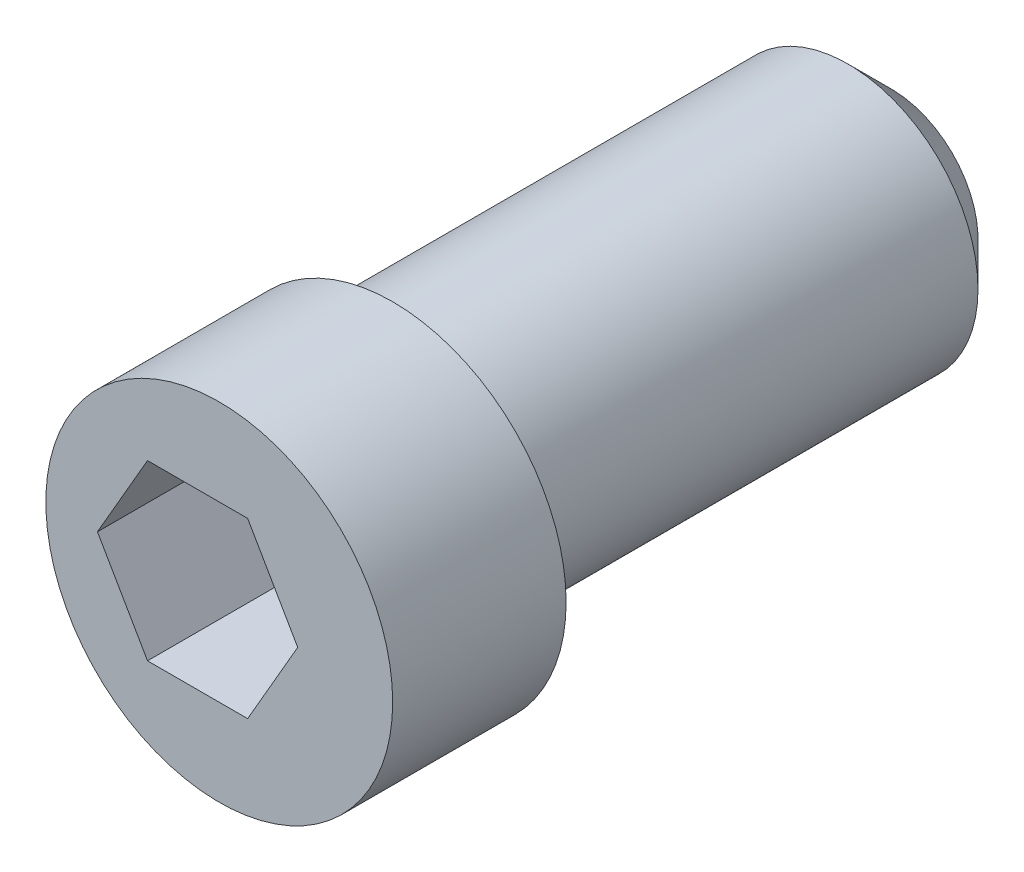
ISO-10303-21;
HEADER;
FILE_DESCRIPTION(('STEP AP214'),'2;1');
FILE_NAME('part.step','',(''),(''),'','','');
FILE_SCHEMA(('AUTOMOTIVE_DESIGN { 1 0 10303 214 1 1 1 1 }'));
ENDSEC;
DATA;
#1=APPLICATION_CONTEXT('core data for automotive mechanical design processes');
#2=APPLICATION_PROTOCOL_DEFINITION('international standard','automotive_design',2000,#1);
#3=PRODUCT_CONTEXT('',#1,'mechanical');
#4=PRODUCT('Part','Part','',(#3));
#5=PRODUCT_RELATED_PRODUCT_CATEGORY('part','',(#4));
#6=PRODUCT_DEFINITION_FORMATION('','',#4);
#7=PRODUCT_DEFINITION_CONTEXT('part definition',#1,'design');
#8=PRODUCT_DEFINITION('design','',#6,#7);
#9=PRODUCT_DEFINITION_SHAPE('','',#8);
#10=(LENGTH_UNIT() NAMED_UNIT(*) SI_UNIT(.MILLI.,.METRE.));
#11=(NAMED_UNIT(*) PLANE_ANGLE_UNIT() SI_UNIT($,.RADIAN.));
#12=(NAMED_UNIT(*) SI_UNIT($,.STERADIAN.) SOLID_ANGLE_UNIT());
#13=UNCERTAINTY_MEASURE_WITH_UNIT(LENGTH_MEASURE(1.E-05),#10,'distance_accuracy_value','');
#14=(GEOMETRIC_REPRESENTATION_CONTEXT(3) GLOBAL_UNCERTAINTY_ASSIGNED_CONTEXT((#13)) GLOBAL_UNIT_ASSIGNED_CONTEXT((#10,
#11,#12)) REPRESENTATION_CONTEXT('',''));
#15=CARTESIAN_POINT('',(0.,0.,0.));
#16=DIRECTION('',(0.,0.,1.));
#17=DIRECTION('',(1.,0.,0.));
#18=AXIS2_PLACEMENT_3D('',#15,#16,#17);
#19=CARTESIAN_POINT('',(0.5,0.,0.));
#20=DIRECTION('',(0.,0.,-1.));
#21=DIRECTION('',(1.,0.,0.));
#22=AXIS2_PLACEMENT_3D('',#19,#20,#21);
#23=PLANE('',#22);
#24=CARTESIAN_POINT('',(0.5,0.,0.));
#25=DIRECTION('',(0.,0.,-1.));
#26=DIRECTION('',(-1.,0.,0.));
#27=AXIS2_PLACEMENT_3D('',#24,#25,#26);
#28=CIRCLE('',#27,4.);
#29=CARTESIAN_POINT('',(-3.5,0.,0.));
#30=VERTEX_POINT('',#29);
#31=EDGE_CURVE('E127',#30,#30,#28,.T.);
#32=ORIENTED_EDGE('',*,*,#31,.T.);
#33=EDGE_LOOP('',(#32));
#34=FACE_BOUND('',#33,.T.);
#35=CARTESIAN_POINT('',(0.,0.,0.));
#36=DIRECTION('',(0.,0.,-1.));
#37=DIRECTION('',(-1.,0.,0.));
#38=AXIS2_PLACEMENT_3D('',#35,#36,#37);
#39=CIRCLE('',#38,3.);
#40=CARTESIAN_POINT('',(-3.,0.,0.));
#41=VERTEX_POINT('',#40);
#42=EDGE_CURVE('E116',#41,#41,#39,.T.);
#43=ORIENTED_EDGE('',*,*,#42,.F.);
#44=EDGE_LOOP('',(#43));
#45=FACE_BOUND('',#44,.T.);
#46=ADVANCED_FACE('F14',(#34,#45),#23,.T.);
#47=CARTESIAN_POINT('',(0.5,0.,-6.));
#48=DIRECTION('',(0.,0.,1.));
#49=DIRECTION('',(1.,0.,0.));
#50=AXIS2_PLACEMENT_3D('',#47,#48,#49);
#51=CYLINDRICAL_SURFACE('',#50,4.);
#52=ORIENTED_EDGE('',*,*,#31,.F.);
#53=EDGE_LOOP('',(#52));
#54=FACE_BOUND('',#53,.T.);
#55=CARTESIAN_POINT('',(0.5,0.,4.));
#56=DIRECTION('',(0.,0.,1.));
#57=DIRECTION('',(1.,0.,0.));
#58=AXIS2_PLACEMENT_3D('',#55,#56,#57);
#59=CIRCLE('',#58,4.);
#60=CARTESIAN_POINT('',(4.5,0.,4.));
#61=VERTEX_POINT('',#60);
#62=EDGE_CURVE('E124',#61,#61,#59,.T.);
#63=ORIENTED_EDGE('',*,*,#62,.F.);
#64=EDGE_LOOP('',(#63));
#65=FACE_BOUND('',#64,.T.);
#66=ADVANCED_FACE('F148',(#54,#65),#51,.T.);
#67=CARTESIAN_POINT('',(0.5,0.,4.));
#68=DIRECTION('',(0.,0.,-1.));
#69=DIRECTION('',(1.,0.,0.));
#70=AXIS2_PLACEMENT_3D('',#67,#68,#69);
#71=PLANE('',#70);
#72=DIRECTION('',(-0.5,0.866025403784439,0.));
#73=VECTOR('',#72,1.);
#74=CARTESIAN_POINT('',(2.30940107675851,0.,4.));
#75=LINE('',#74,#73);
#76=CARTESIAN_POINT('',(2.30940107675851,0.,4.));
#77=VERTEX_POINT('',#76);
#78=CARTESIAN_POINT('',(1.15470053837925,2.,4.));
#79=VERTEX_POINT('',#78);
#80=EDGE_CURVE('E103',#77,#79,#75,.T.);
#81=ORIENTED_EDGE('',*,*,#80,.F.);
#82=DIRECTION('',(0.5,0.866025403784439,0.));
#83=VECTOR('',#82,1.);
#84=CARTESIAN_POINT('',(1.15470053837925,-2.,4.));
#85=LINE('',#84,#83);
#86=CARTESIAN_POINT('',(1.15470053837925,-2.,4.));
#87=VERTEX_POINT('',#86);
#88=EDGE_CURVE('E29',#87,#77,#85,.T.);
#89=ORIENTED_EDGE('',*,*,#88,.F.);
#90=DIRECTION('',(1.,0.,0.));
#91=VECTOR('',#90,1.);
#92=CARTESIAN_POINT('',(-1.15470053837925,-2.,4.));
#93=LINE('',#92,#91);
#94=CARTESIAN_POINT('',(-1.15470053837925,-2.,4.));
#95=VERTEX_POINT('',#94);
#96=EDGE_CURVE('E112',#95,#87,#93,.T.);
#97=ORIENTED_EDGE('',*,*,#96,.F.);
#98=DIRECTION('',(0.5,-0.866025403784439,0.));
#99=VECTOR('',#98,1.);
#100=CARTESIAN_POINT('',(-2.30940107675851,0.,4.));
#101=LINE('',#100,#99);
#102=CARTESIAN_POINT('',(-2.30940107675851,0.,4.));
#103=VERTEX_POINT('',#102);
#104=EDGE_CURVE('E110',#103,#95,#101,.T.);
#105=ORIENTED_EDGE('',*,*,#104,.F.);
#106=DIRECTION('',(-0.5,-0.866025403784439,0.));
#107=VECTOR('',#106,1.);
#108=CARTESIAN_POINT('',(-1.15470053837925,2.,4.));
#109=LINE('',#108,#107);
#110=CARTESIAN_POINT('',(-1.15470053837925,2.,4.));
#111=VERTEX_POINT('',#110);
#112=EDGE_CURVE('E77',#111,#103,#109,.T.);
#113=ORIENTED_EDGE('',*,*,#112,.F.);
#114=DIRECTION('',(-1.,0.,0.));
#115=VECTOR('',#114,1.);
#116=CARTESIAN_POINT('',(1.15470053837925,2.,4.));
#117=LINE('',#116,#115);
#118=EDGE_CURVE('E106',#79,#111,#117,.T.);
#119=ORIENTED_EDGE('',*,*,#118,.F.);
#120=EDGE_LOOP('',(#81,#89,#97,#105,#113,#119));
#121=FACE_BOUND('',#120,.T.);
#122=ORIENTED_EDGE('',*,*,#62,.T.);
#123=EDGE_LOOP('',(#122));
#124=FACE_BOUND('',#123,.T.);
#125=ADVANCED_FACE('F154',(#121,#124),#71,.F.);
#126=CARTESIAN_POINT('',(0.,0.,-12.));
#127=DIRECTION('',(0.,0.,1.));
#128=DIRECTION('',(1.,0.,0.));
#129=AXIS2_PLACEMENT_3D('',#126,#127,#128);
#130=CYLINDRICAL_SURFACE('',#129,3.);
#131=CARTESIAN_POINT('',(0.,0.,-11.));
#132=DIRECTION('',(0.,0.,-1.));
#133=DIRECTION('',(-1.,0.,0.));
#134=AXIS2_PLACEMENT_3D('',#131,#132,#133);
#135=CIRCLE('',#134,3.);
#136=CARTESIAN_POINT('',(-3.,0.,-11.));
#137=VERTEX_POINT('',#136);
#138=EDGE_CURVE('E9',#137,#137,#135,.F.);
#139=ORIENTED_EDGE('',*,*,#138,.T.);
#140=EDGE_LOOP('',(#139));
#141=FACE_BOUND('',#140,.T.);
#142=ORIENTED_EDGE('',*,*,#42,.T.);
#143=EDGE_LOOP('',(#142));
#144=FACE_BOUND('',#143,.T.);
#145=ADVANCED_FACE('F144',(#141,#144),#130,.T.);
#146=CARTESIAN_POINT('',(0.,0.,-12.));
#147=DIRECTION('',(0.,0.,-1.));
#148=DIRECTION('',(-1.,0.,0.));
#149=AXIS2_PLACEMENT_3D('',#146,#147,#148);
#150=PLANE('',#149);
#151=CARTESIAN_POINT('',(0.,0.,-12.));
#152=DIRECTION('',(0.,0.,-1.));
#153=DIRECTION('',(-1.,0.,0.));
#154=AXIS2_PLACEMENT_3D('',#151,#152,#153);
#155=CIRCLE('',#154,2.);
#156=CARTESIAN_POINT('',(-2.,0.,-12.));
#157=VERTEX_POINT('',#156);
#158=EDGE_CURVE('E22',#157,#157,#155,.T.);
#159=ORIENTED_EDGE('',*,*,#158,.T.);
#160=EDGE_LOOP('',(#159));
#161=FACE_BOUND('',#160,.T.);
#162=ADVANCED_FACE('F132',(#161),#150,.T.);
#163=CARTESIAN_POINT('',(0.,0.,-12.));
#164=DIRECTION('',(0.,0.,1.));
#165=DIRECTION('',(1.,0.,0.));
#166=AXIS2_PLACEMENT_3D('',#163,#164,#165);
#167=CONICAL_SURFACE('',#166,2.,0.785398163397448);
#168=ORIENTED_EDGE('',*,*,#138,.F.);
#169=EDGE_LOOP('',(#168));
#170=FACE_BOUND('',#169,.T.);
#171=ORIENTED_EDGE('',*,*,#158,.F.);
#172=EDGE_LOOP('',(#171));
#173=FACE_BOUND('',#172,.T.);
#174=ADVANCED_FACE('F16',(#170,#173),#167,.T.);
#175=CARTESIAN_POINT('',(1.15470053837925,-2.,1.));
#176=DIRECTION('',(0.866025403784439,-0.5,0.));
#177=DIRECTION('',(0.5,0.866025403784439,0.));
#178=AXIS2_PLACEMENT_3D('',#175,#176,#177);
#179=PLANE('',#178);
#180=ORIENTED_EDGE('',*,*,#88,.T.);
#181=DIRECTION('',(0.,0.,1.));
#182=VECTOR('',#181,1.);
#183=CARTESIAN_POINT('',(2.30940107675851,0.,1.));
#184=LINE('',#183,#182);
#185=CARTESIAN_POINT('',(2.30940107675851,0.,1.));
#186=VERTEX_POINT('',#185);
#187=EDGE_CURVE('E59',#186,#77,#184,.T.);
#188=ORIENTED_EDGE('',*,*,#187,.F.);
#189=DIRECTION('',(0.5,0.866025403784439,0.));
#190=VECTOR('',#189,1.);
#191=CARTESIAN_POINT('',(1.15470053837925,-2.,1.));
#192=LINE('',#191,#190);
#193=CARTESIAN_POINT('',(1.15470053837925,-2.,1.));
#194=VERTEX_POINT('',#193);
#195=EDGE_CURVE('E114',#194,#186,#192,.T.);
#196=ORIENTED_EDGE('',*,*,#195,.F.);
#197=DIRECTION('',(0.,0.,1.));
#198=VECTOR('',#197,1.);
#199=CARTESIAN_POINT('',(1.15470053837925,-2.,1.));
#200=LINE('',#199,#198);
#201=EDGE_CURVE('E37',#194,#87,#200,.T.);
#202=ORIENTED_EDGE('',*,*,#201,.T.);
#203=EDGE_LOOP('',(#180,#188,#196,#202));
#204=FACE_BOUND('',#203,.T.);
#205=ADVANCED_FACE('F135',(#204),#179,.F.);
#206=CARTESIAN_POINT('',(-1.15470053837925,-2.,1.));
#207=DIRECTION('',(0.,-1.,0.));
#208=DIRECTION('',(0.,0.,-1.));
#209=AXIS2_PLACEMENT_3D('',#206,#207,#208);
#210=PLANE('',#209);
#211=ORIENTED_EDGE('',*,*,#96,.T.);
#212=ORIENTED_EDGE('',*,*,#201,.F.);
#213=DIRECTION('',(1.,0.,0.));
#214=VECTOR('',#213,1.);
#215=CARTESIAN_POINT('',(-1.15470053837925,-2.,1.));
#216=LINE('',#215,#214);
#217=CARTESIAN_POINT('',(-1.15470053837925,-2.,1.));
#218=VERTEX_POINT('',#217);
#219=EDGE_CURVE('E89',#218,#194,#216,.T.);
#220=ORIENTED_EDGE('',*,*,#219,.F.);
#221=DIRECTION('',(0.,0.,1.));
#222=VECTOR('',#221,1.);
#223=CARTESIAN_POINT('',(-1.15470053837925,-2.,1.));
#224=LINE('',#223,#222);
#225=EDGE_CURVE('E81',#218,#95,#224,.T.);
#226=ORIENTED_EDGE('',*,*,#225,.T.);
#227=EDGE_LOOP('',(#211,#212,#220,#226));
#228=FACE_BOUND('',#227,.T.);
#229=ADVANCED_FACE('F142',(#228),#210,.F.);
#230=CARTESIAN_POINT('',(-2.30940107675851,0.,1.));
#231=DIRECTION('',(-0.866025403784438,-0.5,0.));
#232=DIRECTION('',(0.5,-0.866025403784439,0.));
#233=AXIS2_PLACEMENT_3D('',#230,#231,#232);
#234=PLANE('',#233);
#235=ORIENTED_EDGE('',*,*,#104,.T.);
#236=ORIENTED_EDGE('',*,*,#225,.F.);
#237=DIRECTION('',(0.5,-0.866025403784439,0.));
#238=VECTOR('',#237,1.);
#239=CARTESIAN_POINT('',(-2.30940107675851,0.,1.));
#240=LINE('',#239,#238);
#241=CARTESIAN_POINT('',(-2.30940107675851,0.,1.));
#242=VERTEX_POINT('',#241);
#243=EDGE_CURVE('E85',#242,#218,#240,.T.);
#244=ORIENTED_EDGE('',*,*,#243,.F.);
#245=DIRECTION('',(0.,0.,1.));
#246=VECTOR('',#245,1.);
#247=CARTESIAN_POINT('',(-2.30940107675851,0.,1.));
#248=LINE('',#247,#246);
#249=EDGE_CURVE('E70',#242,#103,#248,.T.);
#250=ORIENTED_EDGE('',*,*,#249,.T.);
#251=EDGE_LOOP('',(#235,#236,#244,#250));
#252=FACE_BOUND('',#251,.T.);
#253=ADVANCED_FACE('F86',(#252),#234,.F.);
#254=CARTESIAN_POINT('',(-1.15470053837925,2.,1.));
#255=DIRECTION('',(-0.866025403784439,0.5,0.));
#256=DIRECTION('',(-0.5,-0.866025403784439,0.));
#257=AXIS2_PLACEMENT_3D('',#254,#255,#256);
#258=PLANE('',#257);
#259=ORIENTED_EDGE('',*,*,#112,.T.);
#260=ORIENTED_EDGE('',*,*,#249,.F.);
#261=DIRECTION('',(-0.5,-0.866025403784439,0.));
#262=VECTOR('',#261,1.);
#263=CARTESIAN_POINT('',(-1.15470053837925,2.,1.));
#264=LINE('',#263,#262);
#265=CARTESIAN_POINT('',(-1.15470053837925,2.,1.));
#266=VERTEX_POINT('',#265);
#267=EDGE_CURVE('E74',#266,#242,#264,.T.);
#268=ORIENTED_EDGE('',*,*,#267,.F.);
#269=DIRECTION('',(0.,0.,1.));
#270=VECTOR('',#269,1.);
#271=CARTESIAN_POINT('',(-1.15470053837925,2.,1.));
#272=LINE('',#271,#270);
#273=EDGE_CURVE('E82',#266,#111,#272,.T.);
#274=ORIENTED_EDGE('',*,*,#273,.T.);
#275=EDGE_LOOP('',(#259,#260,#268,#274));
#276=FACE_BOUND('',#275,.T.);
#277=ADVANCED_FACE('F72',(#276),#258,.F.);
#278=CARTESIAN_POINT('',(1.15470053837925,2.,1.));
#279=DIRECTION('',(0.,1.,0.));
#280=DIRECTION('',(0.,0.,1.));
#281=AXIS2_PLACEMENT_3D('',#278,#279,#280);
#282=PLANE('',#281);
#283=ORIENTED_EDGE('',*,*,#118,.T.);
#284=ORIENTED_EDGE('',*,*,#273,.F.);
#285=DIRECTION('',(-1.,0.,0.));
#286=VECTOR('',#285,1.);
#287=CARTESIAN_POINT('',(1.15470053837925,2.,1.));
#288=LINE('',#287,#286);
#289=CARTESIAN_POINT('',(1.15470053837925,2.,1.));
#290=VERTEX_POINT('',#289);
#291=EDGE_CURVE('E95',#290,#266,#288,.T.);
#292=ORIENTED_EDGE('',*,*,#291,.F.);
#293=DIRECTION('',(0.,0.,1.));
#294=VECTOR('',#293,1.);
#295=CARTESIAN_POINT('',(1.15470053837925,2.,1.));
#296=LINE('',#295,#294);
#297=EDGE_CURVE('E119',#290,#79,#296,.T.);
#298=ORIENTED_EDGE('',*,*,#297,.T.);
#299=EDGE_LOOP('',(#283,#284,#292,#298));
#300=FACE_BOUND('',#299,.T.);
#301=ADVANCED_FACE('F184',(#300),#282,.F.);
#302=CARTESIAN_POINT('',(2.30940107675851,0.,1.));
#303=DIRECTION('',(0.866025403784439,0.5,0.));
#304=DIRECTION('',(-0.5,0.866025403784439,0.));
#305=AXIS2_PLACEMENT_3D('',#302,#303,#304);
#306=PLANE('',#305);
#307=ORIENTED_EDGE('',*,*,#80,.T.);
#308=ORIENTED_EDGE('',*,*,#297,.F.);
#309=DIRECTION('',(-0.5,0.866025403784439,0.));
#310=VECTOR('',#309,1.);
#311=CARTESIAN_POINT('',(2.30940107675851,0.,1.));
#312=LINE('',#311,#310);
#313=EDGE_CURVE('E97',#186,#290,#312,.T.);
#314=ORIENTED_EDGE('',*,*,#313,.F.);
#315=ORIENTED_EDGE('',*,*,#187,.T.);
#316=EDGE_LOOP('',(#307,#308,#314,#315));
#317=FACE_BOUND('',#316,.T.);
#318=ADVANCED_FACE('F172',(#317),#306,.F.);
#319=CARTESIAN_POINT('',(0.,0.,1.));
#320=DIRECTION('',(0.,0.,1.));
#321=DIRECTION('',(1.,0.,0.));
#322=AXIS2_PLACEMENT_3D('',#319,#320,#321);
#323=PLANE('',#322);
#324=ORIENTED_EDGE('',*,*,#195,.T.);
#325=ORIENTED_EDGE('',*,*,#313,.T.);
#326=ORIENTED_EDGE('',*,*,#291,.T.);
#327=ORIENTED_EDGE('',*,*,#267,.T.);
#328=ORIENTED_EDGE('',*,*,#243,.T.);
#329=ORIENTED_EDGE('',*,*,#219,.T.);
#330=EDGE_LOOP('',(#324,#325,#326,#327,#328,#329));
#331=FACE_BOUND('',#330,.T.);
#332=ADVANCED_FACE('F92',(#331),#323,.T.);
#333=CLOSED_SHELL('',(#46,#66,#125,#145,#162,#174,#205,#229,#253,#277,#301,#318,#332));
#334=MANIFOLD_SOLID_BREP('B1',#333);
#335=ADVANCED_BREP_SHAPE_REPRESENTATION('',(#18,#334),#14);
#336=SHAPE_DEFINITION_REPRESENTATION(#9,#335);
ENDSEC;
END-ISO-10303-21;
